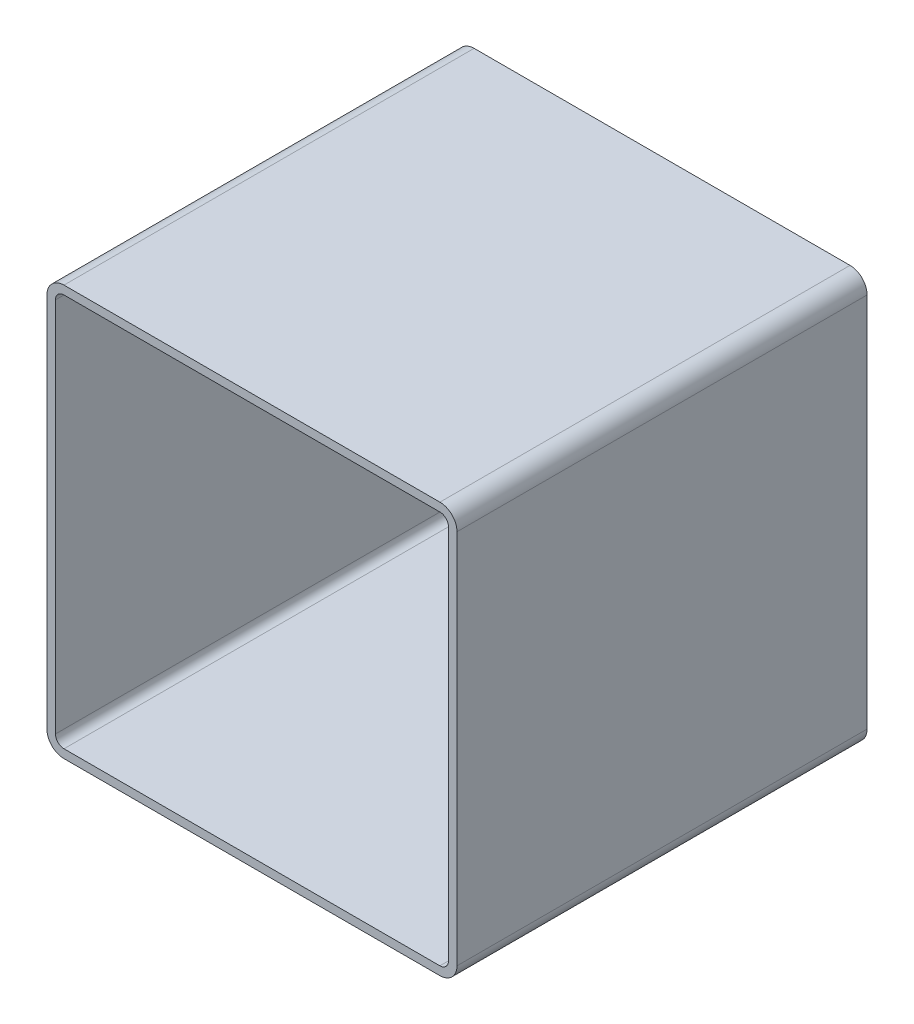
ISO-10303-21;
HEADER;
FILE_DESCRIPTION(('STEP AP214'),'2;1');
FILE_NAME('part.step','',(''),(''),'','','');
FILE_SCHEMA(('AUTOMOTIVE_DESIGN { 1 0 10303 214 1 1 1 1 }'));
ENDSEC;
DATA;
#1=APPLICATION_CONTEXT('core data for automotive mechanical design processes');
#2=APPLICATION_PROTOCOL_DEFINITION('international standard','automotive_design',2000,#1);
#3=PRODUCT_CONTEXT('',#1,'mechanical');
#4=PRODUCT('Part','Part','',(#3));
#5=PRODUCT_RELATED_PRODUCT_CATEGORY('part','',(#4));
#6=PRODUCT_DEFINITION_FORMATION('','',#4);
#7=PRODUCT_DEFINITION_CONTEXT('part definition',#1,'design');
#8=PRODUCT_DEFINITION('design','',#6,#7);
#9=PRODUCT_DEFINITION_SHAPE('','',#8);
#10=(LENGTH_UNIT() NAMED_UNIT(*) SI_UNIT(.MILLI.,.METRE.));
#11=(NAMED_UNIT(*) PLANE_ANGLE_UNIT() SI_UNIT($,.RADIAN.));
#12=(NAMED_UNIT(*) SI_UNIT($,.STERADIAN.) SOLID_ANGLE_UNIT());
#13=UNCERTAINTY_MEASURE_WITH_UNIT(LENGTH_MEASURE(1.E-05),#10,'distance_accuracy_value','');
#14=(GEOMETRIC_REPRESENTATION_CONTEXT(3) GLOBAL_UNCERTAINTY_ASSIGNED_CONTEXT((#13)) GLOBAL_UNIT_ASSIGNED_CONTEXT((#10,
#11,#12)) REPRESENTATION_CONTEXT('',''));
#15=CARTESIAN_POINT('',(0.,0.,0.));
#16=DIRECTION('',(0.,0.,1.));
#17=DIRECTION('',(1.,0.,0.));
#18=AXIS2_PLACEMENT_3D('',#15,#16,#17);
#19=CARTESIAN_POINT('',(13.8067030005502,293.974496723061,304.8));
#20=DIRECTION('',(0.,0.,1.));
#21=DIRECTION('',(1.,0.,0.));
#22=AXIS2_PLACEMENT_3D('',#19,#20,#21);
#23=PLANE('',#22);
#24=CARTESIAN_POINT('',(13.8067030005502,293.974496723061,304.8));
#25=DIRECTION('',(0.,0.,1.));
#26=DIRECTION('',(1.,0.,0.));
#27=AXIS2_PLACEMENT_3D('',#24,#25,#26);
#28=CIRCLE('',#27,12.7);
#29=CARTESIAN_POINT('',(13.8067030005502,306.674496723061,304.8));
#30=VERTEX_POINT('',#29);
#31=CARTESIAN_POINT('',(1.10670300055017,293.974496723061,304.8));
#32=VERTEX_POINT('',#31);
#33=EDGE_CURVE('E211',#30,#32,#28,.T.);
#34=ORIENTED_EDGE('',*,*,#33,.T.);
#35=DIRECTION('',(0.,-1.,0.));
#36=VECTOR('',#35,1.);
#37=CARTESIAN_POINT('',(1.10670300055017,14.5744967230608,304.8));
#38=LINE('',#37,#36);
#39=CARTESIAN_POINT('',(1.10670300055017,14.5744967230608,304.8));
#40=VERTEX_POINT('',#39);
#41=EDGE_CURVE('E214',#32,#40,#38,.T.);
#42=ORIENTED_EDGE('',*,*,#41,.T.);
#43=CARTESIAN_POINT('',(13.8067030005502,14.5744967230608,304.8));
#44=DIRECTION('',(0.,0.,1.));
#45=DIRECTION('',(1.,0.,0.));
#46=AXIS2_PLACEMENT_3D('',#43,#44,#45);
#47=CIRCLE('',#46,12.7);
#48=CARTESIAN_POINT('',(13.8067030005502,1.87449672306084,304.8));
#49=VERTEX_POINT('',#48);
#50=EDGE_CURVE('E217',#40,#49,#47,.T.);
#51=ORIENTED_EDGE('',*,*,#50,.T.);
#52=DIRECTION('',(1.,0.,0.));
#53=VECTOR('',#52,1.);
#54=CARTESIAN_POINT('',(293.20670300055,1.87449672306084,304.8));
#55=LINE('',#54,#53);
#56=CARTESIAN_POINT('',(293.20670300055,1.87449672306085,304.8));
#57=VERTEX_POINT('',#56);
#58=EDGE_CURVE('E219',#49,#57,#55,.T.);
#59=ORIENTED_EDGE('',*,*,#58,.T.);
#60=CARTESIAN_POINT('',(293.20670300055,14.5744967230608,304.8));
#61=DIRECTION('',(0.,0.,1.));
#62=DIRECTION('',(1.,0.,0.));
#63=AXIS2_PLACEMENT_3D('',#60,#61,#62);
#64=CIRCLE('',#63,12.7);
#65=CARTESIAN_POINT('',(305.90670300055,14.5744967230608,304.8));
#66=VERTEX_POINT('',#65);
#67=EDGE_CURVE('E221',#57,#66,#64,.T.);
#68=ORIENTED_EDGE('',*,*,#67,.T.);
#69=DIRECTION('',(0.,1.,0.));
#70=VECTOR('',#69,1.);
#71=CARTESIAN_POINT('',(305.90670300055,293.974496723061,304.8));
#72=LINE('',#71,#70);
#73=CARTESIAN_POINT('',(305.90670300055,293.974496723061,304.8));
#74=VERTEX_POINT('',#73);
#75=EDGE_CURVE('E223',#66,#74,#72,.T.);
#76=ORIENTED_EDGE('',*,*,#75,.T.);
#77=CARTESIAN_POINT('',(293.20670300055,293.974496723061,304.8));
#78=DIRECTION('',(0.,0.,1.));
#79=DIRECTION('',(1.,0.,0.));
#80=AXIS2_PLACEMENT_3D('',#77,#78,#79);
#81=CIRCLE('',#80,12.7);
#82=CARTESIAN_POINT('',(293.20670300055,306.674496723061,304.8));
#83=VERTEX_POINT('',#82);
#84=EDGE_CURVE('E225',#74,#83,#81,.T.);
#85=ORIENTED_EDGE('',*,*,#84,.T.);
#86=DIRECTION('',(-1.,0.,0.));
#87=VECTOR('',#86,1.);
#88=CARTESIAN_POINT('',(13.8067030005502,306.674496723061,304.8));
#89=LINE('',#88,#87);
#90=EDGE_CURVE('E227',#83,#30,#89,.T.);
#91=ORIENTED_EDGE('',*,*,#90,.T.);
#92=EDGE_LOOP('',(#34,#42,#51,#59,#68,#76,#85,#91));
#93=FACE_BOUND('',#92,.T.);
#94=DIRECTION('',(0.,-1.,0.));
#95=VECTOR('',#94,1.);
#96=CARTESIAN_POINT('',(7.45670300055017,14.5744967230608,304.8));
#97=LINE('',#96,#95);
#98=CARTESIAN_POINT('',(7.45670300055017,293.974496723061,304.8));
#99=VERTEX_POINT('',#98);
#100=CARTESIAN_POINT('',(7.45670300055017,14.5744967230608,304.8));
#101=VERTEX_POINT('',#100);
#102=EDGE_CURVE('E154',#99,#101,#97,.T.);
#103=ORIENTED_EDGE('',*,*,#102,.F.);
#104=CARTESIAN_POINT('',(13.8067030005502,293.974496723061,304.8));
#105=DIRECTION('',(0.,0.,1.));
#106=DIRECTION('',(1.,0.,0.));
#107=AXIS2_PLACEMENT_3D('',#104,#105,#106);
#108=CIRCLE('',#107,6.35000000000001);
#109=CARTESIAN_POINT('',(13.8067030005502,300.324496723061,304.8));
#110=VERTEX_POINT('',#109);
#111=EDGE_CURVE('E146',#110,#99,#108,.T.);
#112=ORIENTED_EDGE('',*,*,#111,.F.);
#113=DIRECTION('',(-1.,0.,0.));
#114=VECTOR('',#113,1.);
#115=CARTESIAN_POINT('',(13.8067030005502,300.324496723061,304.8));
#116=LINE('',#115,#114);
#117=CARTESIAN_POINT('',(293.20670300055,300.324496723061,304.8));
#118=VERTEX_POINT('',#117);
#119=EDGE_CURVE('E179',#118,#110,#116,.T.);
#120=ORIENTED_EDGE('',*,*,#119,.F.);
#121=CARTESIAN_POINT('',(293.20670300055,293.974496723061,304.8));
#122=DIRECTION('',(0.,0.,1.));
#123=DIRECTION('',(1.,0.,0.));
#124=AXIS2_PLACEMENT_3D('',#121,#122,#123);
#125=CIRCLE('',#124,6.34999999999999);
#126=CARTESIAN_POINT('',(299.55670300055,293.974496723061,304.8));
#127=VERTEX_POINT('',#126);
#128=EDGE_CURVE('E177',#127,#118,#125,.T.);
#129=ORIENTED_EDGE('',*,*,#128,.F.);
#130=DIRECTION('',(0.,1.,0.));
#131=VECTOR('',#130,1.);
#132=CARTESIAN_POINT('',(299.55670300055,293.974496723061,304.8));
#133=LINE('',#132,#131);
#134=CARTESIAN_POINT('',(299.55670300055,14.5744967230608,304.8));
#135=VERTEX_POINT('',#134);
#136=EDGE_CURVE('E175',#135,#127,#133,.T.);
#137=ORIENTED_EDGE('',*,*,#136,.F.);
#138=CARTESIAN_POINT('',(293.20670300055,14.5744967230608,304.8));
#139=DIRECTION('',(0.,0.,1.));
#140=DIRECTION('',(1.,0.,0.));
#141=AXIS2_PLACEMENT_3D('',#138,#139,#140);
#142=CIRCLE('',#141,6.34999999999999);
#143=CARTESIAN_POINT('',(293.20670300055,8.22449672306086,304.8));
#144=VERTEX_POINT('',#143);
#145=EDGE_CURVE('E173',#144,#135,#142,.T.);
#146=ORIENTED_EDGE('',*,*,#145,.F.);
#147=DIRECTION('',(1.,0.,0.));
#148=VECTOR('',#147,1.);
#149=CARTESIAN_POINT('',(293.20670300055,8.22449672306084,304.8));
#150=LINE('',#149,#148);
#151=CARTESIAN_POINT('',(13.8067030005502,8.22449672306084,304.8));
#152=VERTEX_POINT('',#151);
#153=EDGE_CURVE('E169',#152,#144,#150,.T.);
#154=ORIENTED_EDGE('',*,*,#153,.F.);
#155=CARTESIAN_POINT('',(13.8067030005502,14.5744967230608,304.8));
#156=DIRECTION('',(0.,0.,1.));
#157=DIRECTION('',(1.,0.,0.));
#158=AXIS2_PLACEMENT_3D('',#155,#156,#157);
#159=CIRCLE('',#158,6.35);
#160=EDGE_CURVE('E167',#101,#152,#159,.T.);
#161=ORIENTED_EDGE('',*,*,#160,.F.);
#162=EDGE_LOOP('',(#103,#112,#120,#129,#137,#146,#154,#161));
#163=FACE_BOUND('',#162,.T.);
#164=ADVANCED_FACE('F33',(#93,#163),#23,.T.);
#165=CARTESIAN_POINT('',(13.8067030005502,293.974496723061,0.));
#166=DIRECTION('',(0.,0.,1.));
#167=DIRECTION('',(1.,0.,0.));
#168=AXIS2_PLACEMENT_3D('',#165,#166,#167);
#169=PLANE('',#168);
#170=CARTESIAN_POINT('',(13.8067030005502,293.974496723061,0.));
#171=DIRECTION('',(0.,0.,1.));
#172=DIRECTION('',(1.,0.,0.));
#173=AXIS2_PLACEMENT_3D('',#170,#171,#172);
#174=CIRCLE('',#173,12.7);
#175=CARTESIAN_POINT('',(13.8067030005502,306.674496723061,0.));
#176=VERTEX_POINT('',#175);
#177=CARTESIAN_POINT('',(1.10670300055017,293.974496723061,0.));
#178=VERTEX_POINT('',#177);
#179=EDGE_CURVE('E162',#176,#178,#174,.T.);
#180=ORIENTED_EDGE('',*,*,#179,.F.);
#181=DIRECTION('',(-1.,0.,0.));
#182=VECTOR('',#181,1.);
#183=CARTESIAN_POINT('',(13.8067030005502,306.674496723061,0.));
#184=LINE('',#183,#182);
#185=CARTESIAN_POINT('',(293.20670300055,306.674496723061,0.));
#186=VERTEX_POINT('',#185);
#187=EDGE_CURVE('E215',#186,#176,#184,.T.);
#188=ORIENTED_EDGE('',*,*,#187,.F.);
#189=CARTESIAN_POINT('',(293.20670300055,293.974496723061,0.));
#190=DIRECTION('',(0.,0.,1.));
#191=DIRECTION('',(1.,0.,0.));
#192=AXIS2_PLACEMENT_3D('',#189,#190,#191);
#193=CIRCLE('',#192,12.7);
#194=CARTESIAN_POINT('',(305.90670300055,293.974496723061,0.));
#195=VERTEX_POINT('',#194);
#196=EDGE_CURVE('E242',#195,#186,#193,.T.);
#197=ORIENTED_EDGE('',*,*,#196,.F.);
#198=DIRECTION('',(0.,1.,0.));
#199=VECTOR('',#198,1.);
#200=CARTESIAN_POINT('',(305.90670300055,293.974496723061,0.));
#201=LINE('',#200,#199);
#202=CARTESIAN_POINT('',(305.90670300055,14.5744967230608,0.));
#203=VERTEX_POINT('',#202);
#204=EDGE_CURVE('E240',#203,#195,#201,.T.);
#205=ORIENTED_EDGE('',*,*,#204,.F.);
#206=CARTESIAN_POINT('',(293.20670300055,14.5744967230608,0.));
#207=DIRECTION('',(0.,0.,1.));
#208=DIRECTION('',(1.,0.,0.));
#209=AXIS2_PLACEMENT_3D('',#206,#207,#208);
#210=CIRCLE('',#209,12.7);
#211=CARTESIAN_POINT('',(293.20670300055,1.87449672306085,0.));
#212=VERTEX_POINT('',#211);
#213=EDGE_CURVE('E238',#212,#203,#210,.T.);
#214=ORIENTED_EDGE('',*,*,#213,.F.);
#215=DIRECTION('',(1.,0.,0.));
#216=VECTOR('',#215,1.);
#217=CARTESIAN_POINT('',(293.20670300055,1.87449672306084,0.));
#218=LINE('',#217,#216);
#219=CARTESIAN_POINT('',(13.8067030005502,1.87449672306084,0.));
#220=VERTEX_POINT('',#219);
#221=EDGE_CURVE('E236',#220,#212,#218,.T.);
#222=ORIENTED_EDGE('',*,*,#221,.F.);
#223=CARTESIAN_POINT('',(13.8067030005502,14.5744967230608,0.));
#224=DIRECTION('',(0.,0.,1.));
#225=DIRECTION('',(1.,0.,0.));
#226=AXIS2_PLACEMENT_3D('',#223,#224,#225);
#227=CIRCLE('',#226,12.7);
#228=CARTESIAN_POINT('',(1.10670300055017,14.5744967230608,0.));
#229=VERTEX_POINT('',#228);
#230=EDGE_CURVE('E234',#229,#220,#227,.T.);
#231=ORIENTED_EDGE('',*,*,#230,.F.);
#232=DIRECTION('',(0.,-1.,0.));
#233=VECTOR('',#232,1.);
#234=CARTESIAN_POINT('',(1.10670300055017,14.5744967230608,0.));
#235=LINE('',#234,#233);
#236=EDGE_CURVE('E232',#178,#229,#235,.T.);
#237=ORIENTED_EDGE('',*,*,#236,.F.);
#238=EDGE_LOOP('',(#180,#188,#197,#205,#214,#222,#231,#237));
#239=FACE_BOUND('',#238,.T.);
#240=CARTESIAN_POINT('',(13.8067030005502,293.974496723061,0.));
#241=DIRECTION('',(0.,0.,1.));
#242=DIRECTION('',(1.,0.,0.));
#243=AXIS2_PLACEMENT_3D('',#240,#241,#242);
#244=CIRCLE('',#243,6.35000000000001);
#245=CARTESIAN_POINT('',(13.8067030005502,300.324496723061,0.));
#246=VERTEX_POINT('',#245);
#247=CARTESIAN_POINT('',(7.45670300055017,293.974496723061,0.));
#248=VERTEX_POINT('',#247);
#249=EDGE_CURVE('E56',#246,#248,#244,.T.);
#250=ORIENTED_EDGE('',*,*,#249,.T.);
#251=DIRECTION('',(0.,-1.,0.));
#252=VECTOR('',#251,1.);
#253=CARTESIAN_POINT('',(7.45670300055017,14.5744967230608,0.));
#254=LINE('',#253,#252);
#255=CARTESIAN_POINT('',(7.45670300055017,14.5744967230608,0.));
#256=VERTEX_POINT('',#255);
#257=EDGE_CURVE('E161',#248,#256,#254,.T.);
#258=ORIENTED_EDGE('',*,*,#257,.T.);
#259=CARTESIAN_POINT('',(13.8067030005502,14.5744967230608,0.));
#260=DIRECTION('',(0.,0.,1.));
#261=DIRECTION('',(1.,0.,0.));
#262=AXIS2_PLACEMENT_3D('',#259,#260,#261);
#263=CIRCLE('',#262,6.35);
#264=CARTESIAN_POINT('',(13.8067030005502,8.22449672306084,0.));
#265=VERTEX_POINT('',#264);
#266=EDGE_CURVE('E183',#256,#265,#263,.T.);
#267=ORIENTED_EDGE('',*,*,#266,.T.);
#268=DIRECTION('',(1.,0.,0.));
#269=VECTOR('',#268,1.);
#270=CARTESIAN_POINT('',(293.20670300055,8.22449672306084,0.));
#271=LINE('',#270,#269);
#272=CARTESIAN_POINT('',(293.20670300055,8.22449672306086,0.));
#273=VERTEX_POINT('',#272);
#274=EDGE_CURVE('E186',#265,#273,#271,.T.);
#275=ORIENTED_EDGE('',*,*,#274,.T.);
#276=CARTESIAN_POINT('',(293.20670300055,14.5744967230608,0.));
#277=DIRECTION('',(0.,0.,1.));
#278=DIRECTION('',(1.,0.,0.));
#279=AXIS2_PLACEMENT_3D('',#276,#277,#278);
#280=CIRCLE('',#279,6.34999999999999);
#281=CARTESIAN_POINT('',(299.55670300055,14.5744967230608,0.));
#282=VERTEX_POINT('',#281);
#283=EDGE_CURVE('E189',#273,#282,#280,.T.);
#284=ORIENTED_EDGE('',*,*,#283,.T.);
#285=DIRECTION('',(0.,1.,0.));
#286=VECTOR('',#285,1.);
#287=CARTESIAN_POINT('',(299.55670300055,293.974496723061,0.));
#288=LINE('',#287,#286);
#289=CARTESIAN_POINT('',(299.55670300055,293.974496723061,0.));
#290=VERTEX_POINT('',#289);
#291=EDGE_CURVE('E192',#282,#290,#288,.T.);
#292=ORIENTED_EDGE('',*,*,#291,.T.);
#293=CARTESIAN_POINT('',(293.20670300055,293.974496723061,0.));
#294=DIRECTION('',(0.,0.,1.));
#295=DIRECTION('',(1.,0.,0.));
#296=AXIS2_PLACEMENT_3D('',#293,#294,#295);
#297=CIRCLE('',#296,6.34999999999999);
#298=CARTESIAN_POINT('',(293.20670300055,300.324496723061,0.));
#299=VERTEX_POINT('',#298);
#300=EDGE_CURVE('E195',#290,#299,#297,.T.);
#301=ORIENTED_EDGE('',*,*,#300,.T.);
#302=DIRECTION('',(-1.,0.,0.));
#303=VECTOR('',#302,1.);
#304=CARTESIAN_POINT('',(13.8067030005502,300.324496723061,0.));
#305=LINE('',#304,#303);
#306=EDGE_CURVE('E155',#299,#246,#305,.T.);
#307=ORIENTED_EDGE('',*,*,#306,.T.);
#308=EDGE_LOOP('',(#250,#258,#267,#275,#284,#292,#301,#307));
#309=FACE_BOUND('',#308,.T.);
#310=ADVANCED_FACE('F272',(#239,#309),#169,.F.);
#311=CARTESIAN_POINT('',(13.8067030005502,293.974496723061,304.8));
#312=DIRECTION('',(0.,0.,-1.));
#313=DIRECTION('',(-1.,0.,0.));
#314=AXIS2_PLACEMENT_3D('',#311,#312,#313);
#315=CYLINDRICAL_SURFACE('',#314,12.7);
#316=ORIENTED_EDGE('',*,*,#179,.T.);
#317=DIRECTION('',(0.,0.,-1.));
#318=VECTOR('',#317,1.);
#319=CARTESIAN_POINT('',(1.10670300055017,293.974496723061,304.8));
#320=LINE('',#319,#318);
#321=EDGE_CURVE('E11',#32,#178,#320,.T.);
#322=ORIENTED_EDGE('',*,*,#321,.F.);
#323=ORIENTED_EDGE('',*,*,#33,.F.);
#324=DIRECTION('',(0.,0.,-1.));
#325=VECTOR('',#324,1.);
#326=CARTESIAN_POINT('',(13.8067030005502,306.674496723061,304.8));
#327=LINE('',#326,#325);
#328=EDGE_CURVE('E229',#30,#176,#327,.T.);
#329=ORIENTED_EDGE('',*,*,#328,.T.);
#330=EDGE_LOOP('',(#316,#322,#323,#329));
#331=FACE_BOUND('',#330,.T.);
#332=ADVANCED_FACE('F35',(#331),#315,.T.);
#333=CARTESIAN_POINT('',(1.10670300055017,14.5744967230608,304.8));
#334=DIRECTION('',(1.,0.,0.));
#335=DIRECTION('',(0.,0.,-1.));
#336=AXIS2_PLACEMENT_3D('',#333,#334,#335);
#337=PLANE('',#336);
#338=ORIENTED_EDGE('',*,*,#236,.T.);
#339=DIRECTION('',(0.,0.,-1.));
#340=VECTOR('',#339,1.);
#341=CARTESIAN_POINT('',(1.10670300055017,14.5744967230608,304.8));
#342=LINE('',#341,#340);
#343=EDGE_CURVE('E41',#40,#229,#342,.T.);
#344=ORIENTED_EDGE('',*,*,#343,.F.);
#345=ORIENTED_EDGE('',*,*,#41,.F.);
#346=ORIENTED_EDGE('',*,*,#321,.T.);
#347=EDGE_LOOP('',(#338,#344,#345,#346));
#348=FACE_BOUND('',#347,.T.);
#349=ADVANCED_FACE('F289',(#348),#337,.F.);
#350=CARTESIAN_POINT('',(13.8067030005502,14.5744967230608,304.8));
#351=DIRECTION('',(0.,0.,-1.));
#352=DIRECTION('',(-1.,0.,0.));
#353=AXIS2_PLACEMENT_3D('',#350,#351,#352);
#354=CYLINDRICAL_SURFACE('',#353,12.7);
#355=ORIENTED_EDGE('',*,*,#230,.T.);
#356=DIRECTION('',(0.,0.,-1.));
#357=VECTOR('',#356,1.);
#358=CARTESIAN_POINT('',(13.8067030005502,1.87449672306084,304.8));
#359=LINE('',#358,#357);
#360=EDGE_CURVE('E259',#49,#220,#359,.T.);
#361=ORIENTED_EDGE('',*,*,#360,.F.);
#362=ORIENTED_EDGE('',*,*,#50,.F.);
#363=ORIENTED_EDGE('',*,*,#343,.T.);
#364=EDGE_LOOP('',(#355,#361,#362,#363));
#365=FACE_BOUND('',#364,.T.);
#366=ADVANCED_FACE('F266',(#365),#354,.T.);
#367=CARTESIAN_POINT('',(293.20670300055,1.87449672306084,304.8));
#368=DIRECTION('',(0.,1.,0.));
#369=DIRECTION('',(0.,0.,1.));
#370=AXIS2_PLACEMENT_3D('',#367,#368,#369);
#371=PLANE('',#370);
#372=ORIENTED_EDGE('',*,*,#221,.T.);
#373=DIRECTION('',(0.,0.,-1.));
#374=VECTOR('',#373,1.);
#375=CARTESIAN_POINT('',(293.20670300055,1.87449672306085,304.8));
#376=LINE('',#375,#374);
#377=EDGE_CURVE('E256',#57,#212,#376,.T.);
#378=ORIENTED_EDGE('',*,*,#377,.F.);
#379=ORIENTED_EDGE('',*,*,#58,.F.);
#380=ORIENTED_EDGE('',*,*,#360,.T.);
#381=EDGE_LOOP('',(#372,#378,#379,#380));
#382=FACE_BOUND('',#381,.T.);
#383=ADVANCED_FACE('F278',(#382),#371,.F.);
#384=CARTESIAN_POINT('',(293.20670300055,14.5744967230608,304.8));
#385=DIRECTION('',(0.,0.,-1.));
#386=DIRECTION('',(-1.,0.,0.));
#387=AXIS2_PLACEMENT_3D('',#384,#385,#386);
#388=CYLINDRICAL_SURFACE('',#387,12.7);
#389=ORIENTED_EDGE('',*,*,#213,.T.);
#390=DIRECTION('',(0.,0.,-1.));
#391=VECTOR('',#390,1.);
#392=CARTESIAN_POINT('',(305.90670300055,14.5744967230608,304.8));
#393=LINE('',#392,#391);
#394=EDGE_CURVE('E253',#66,#203,#393,.T.);
#395=ORIENTED_EDGE('',*,*,#394,.F.);
#396=ORIENTED_EDGE('',*,*,#67,.F.);
#397=ORIENTED_EDGE('',*,*,#377,.T.);
#398=EDGE_LOOP('',(#389,#395,#396,#397));
#399=FACE_BOUND('',#398,.T.);
#400=ADVANCED_FACE('F282',(#399),#388,.T.);
#401=CARTESIAN_POINT('',(305.90670300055,293.974496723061,304.8));
#402=DIRECTION('',(-1.,0.,0.));
#403=DIRECTION('',(0.,0.,1.));
#404=AXIS2_PLACEMENT_3D('',#401,#402,#403);
#405=PLANE('',#404);
#406=ORIENTED_EDGE('',*,*,#204,.T.);
#407=DIRECTION('',(0.,0.,-1.));
#408=VECTOR('',#407,1.);
#409=CARTESIAN_POINT('',(305.90670300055,293.974496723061,304.8));
#410=LINE('',#409,#408);
#411=EDGE_CURVE('E250',#74,#195,#410,.T.);
#412=ORIENTED_EDGE('',*,*,#411,.F.);
#413=ORIENTED_EDGE('',*,*,#75,.F.);
#414=ORIENTED_EDGE('',*,*,#394,.T.);
#415=EDGE_LOOP('',(#406,#412,#413,#414));
#416=FACE_BOUND('',#415,.T.);
#417=ADVANCED_FACE('F302',(#416),#405,.F.);
#418=CARTESIAN_POINT('',(293.20670300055,293.974496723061,304.8));
#419=DIRECTION('',(0.,0.,-1.));
#420=DIRECTION('',(-1.,0.,0.));
#421=AXIS2_PLACEMENT_3D('',#418,#419,#420);
#422=CYLINDRICAL_SURFACE('',#421,12.7);
#423=ORIENTED_EDGE('',*,*,#196,.T.);
#424=DIRECTION('',(0.,0.,-1.));
#425=VECTOR('',#424,1.);
#426=CARTESIAN_POINT('',(293.20670300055,306.674496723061,304.8));
#427=LINE('',#426,#425);
#428=EDGE_CURVE('E247',#83,#186,#427,.T.);
#429=ORIENTED_EDGE('',*,*,#428,.F.);
#430=ORIENTED_EDGE('',*,*,#84,.F.);
#431=ORIENTED_EDGE('',*,*,#411,.T.);
#432=EDGE_LOOP('',(#423,#429,#430,#431));
#433=FACE_BOUND('',#432,.T.);
#434=ADVANCED_FACE('F300',(#433),#422,.T.);
#435=CARTESIAN_POINT('',(13.8067030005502,306.674496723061,304.8));
#436=DIRECTION('',(0.,-1.,0.));
#437=DIRECTION('',(0.,0.,-1.));
#438=AXIS2_PLACEMENT_3D('',#435,#436,#437);
#439=PLANE('',#438);
#440=ORIENTED_EDGE('',*,*,#187,.T.);
#441=ORIENTED_EDGE('',*,*,#328,.F.);
#442=ORIENTED_EDGE('',*,*,#90,.F.);
#443=ORIENTED_EDGE('',*,*,#428,.T.);
#444=EDGE_LOOP('',(#440,#441,#442,#443));
#445=FACE_BOUND('',#444,.T.);
#446=ADVANCED_FACE('F295',(#445),#439,.F.);
#447=CARTESIAN_POINT('',(13.8067030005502,293.974496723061,304.8));
#448=DIRECTION('',(0.,0.,-1.));
#449=DIRECTION('',(-1.,0.,0.));
#450=AXIS2_PLACEMENT_3D('',#447,#448,#449);
#451=CYLINDRICAL_SURFACE('',#450,6.35000000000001);
#452=ORIENTED_EDGE('',*,*,#249,.F.);
#453=DIRECTION('',(0.,0.,-1.));
#454=VECTOR('',#453,1.);
#455=CARTESIAN_POINT('',(13.8067030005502,300.324496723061,304.8));
#456=LINE('',#455,#454);
#457=EDGE_CURVE('E150',#110,#246,#456,.T.);
#458=ORIENTED_EDGE('',*,*,#457,.F.);
#459=ORIENTED_EDGE('',*,*,#111,.T.);
#460=DIRECTION('',(0.,0.,-1.));
#461=VECTOR('',#460,1.);
#462=CARTESIAN_POINT('',(7.45670300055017,293.974496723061,304.8));
#463=LINE('',#462,#461);
#464=EDGE_CURVE('E149',#99,#248,#463,.T.);
#465=ORIENTED_EDGE('',*,*,#464,.T.);
#466=EDGE_LOOP('',(#452,#458,#459,#465));
#467=FACE_BOUND('',#466,.T.);
#468=ADVANCED_FACE('F148',(#467),#451,.F.);
#469=CARTESIAN_POINT('',(7.45670300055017,14.5744967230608,304.8));
#470=DIRECTION('',(1.,0.,0.));
#471=DIRECTION('',(0.,0.,-1.));
#472=AXIS2_PLACEMENT_3D('',#469,#470,#471);
#473=PLANE('',#472);
#474=ORIENTED_EDGE('',*,*,#257,.F.);
#475=ORIENTED_EDGE('',*,*,#464,.F.);
#476=ORIENTED_EDGE('',*,*,#102,.T.);
#477=DIRECTION('',(0.,0.,-1.));
#478=VECTOR('',#477,1.);
#479=CARTESIAN_POINT('',(7.45670300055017,14.5744967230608,304.8));
#480=LINE('',#479,#478);
#481=EDGE_CURVE('E163',#101,#256,#480,.T.);
#482=ORIENTED_EDGE('',*,*,#481,.T.);
#483=EDGE_LOOP('',(#474,#475,#476,#482));
#484=FACE_BOUND('',#483,.T.);
#485=ADVANCED_FACE('F158',(#484),#473,.T.);
#486=CARTESIAN_POINT('',(13.8067030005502,14.5744967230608,304.8));
#487=DIRECTION('',(0.,0.,-1.));
#488=DIRECTION('',(-1.,0.,0.));
#489=AXIS2_PLACEMENT_3D('',#486,#487,#488);
#490=CYLINDRICAL_SURFACE('',#489,6.35);
#491=ORIENTED_EDGE('',*,*,#266,.F.);
#492=ORIENTED_EDGE('',*,*,#481,.F.);
#493=ORIENTED_EDGE('',*,*,#160,.T.);
#494=DIRECTION('',(0.,0.,-1.));
#495=VECTOR('',#494,1.);
#496=CARTESIAN_POINT('',(13.8067030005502,8.22449672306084,304.8));
#497=LINE('',#496,#495);
#498=EDGE_CURVE('E208',#152,#265,#497,.T.);
#499=ORIENTED_EDGE('',*,*,#498,.T.);
#500=EDGE_LOOP('',(#491,#492,#493,#499));
#501=FACE_BOUND('',#500,.T.);
#502=ADVANCED_FACE('F327',(#501),#490,.F.);
#503=CARTESIAN_POINT('',(293.20670300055,8.22449672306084,304.8));
#504=DIRECTION('',(0.,1.,0.));
#505=DIRECTION('',(0.,0.,1.));
#506=AXIS2_PLACEMENT_3D('',#503,#504,#505);
#507=PLANE('',#506);
#508=ORIENTED_EDGE('',*,*,#274,.F.);
#509=ORIENTED_EDGE('',*,*,#498,.F.);
#510=ORIENTED_EDGE('',*,*,#153,.T.);
#511=DIRECTION('',(0.,0.,-1.));
#512=VECTOR('',#511,1.);
#513=CARTESIAN_POINT('',(293.20670300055,8.22449672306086,304.8));
#514=LINE('',#513,#512);
#515=EDGE_CURVE('E206',#144,#273,#514,.T.);
#516=ORIENTED_EDGE('',*,*,#515,.T.);
#517=EDGE_LOOP('',(#508,#509,#510,#516));
#518=FACE_BOUND('',#517,.T.);
#519=ADVANCED_FACE('F331',(#518),#507,.T.);
#520=CARTESIAN_POINT('',(293.20670300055,14.5744967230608,304.8));
#521=DIRECTION('',(0.,0.,-1.));
#522=DIRECTION('',(-1.,0.,0.));
#523=AXIS2_PLACEMENT_3D('',#520,#521,#522);
#524=CYLINDRICAL_SURFACE('',#523,6.34999999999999);
#525=ORIENTED_EDGE('',*,*,#283,.F.);
#526=ORIENTED_EDGE('',*,*,#515,.F.);
#527=ORIENTED_EDGE('',*,*,#145,.T.);
#528=DIRECTION('',(0.,0.,-1.));
#529=VECTOR('',#528,1.);
#530=CARTESIAN_POINT('',(299.55670300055,14.5744967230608,304.8));
#531=LINE('',#530,#529);
#532=EDGE_CURVE('E204',#135,#282,#531,.T.);
#533=ORIENTED_EDGE('',*,*,#532,.T.);
#534=EDGE_LOOP('',(#525,#526,#527,#533));
#535=FACE_BOUND('',#534,.T.);
#536=ADVANCED_FACE('F337',(#535),#524,.F.);
#537=CARTESIAN_POINT('',(299.55670300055,293.974496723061,304.8));
#538=DIRECTION('',(-1.,0.,0.));
#539=DIRECTION('',(0.,0.,1.));
#540=AXIS2_PLACEMENT_3D('',#537,#538,#539);
#541=PLANE('',#540);
#542=ORIENTED_EDGE('',*,*,#291,.F.);
#543=ORIENTED_EDGE('',*,*,#532,.F.);
#544=ORIENTED_EDGE('',*,*,#136,.T.);
#545=DIRECTION('',(0.,0.,-1.));
#546=VECTOR('',#545,1.);
#547=CARTESIAN_POINT('',(299.55670300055,293.974496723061,304.8));
#548=LINE('',#547,#546);
#549=EDGE_CURVE('E202',#127,#290,#548,.T.);
#550=ORIENTED_EDGE('',*,*,#549,.T.);
#551=EDGE_LOOP('',(#542,#543,#544,#550));
#552=FACE_BOUND('',#551,.T.);
#553=ADVANCED_FACE('F341',(#552),#541,.T.);
#554=CARTESIAN_POINT('',(293.20670300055,293.974496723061,304.8));
#555=DIRECTION('',(0.,0.,-1.));
#556=DIRECTION('',(-1.,0.,0.));
#557=AXIS2_PLACEMENT_3D('',#554,#555,#556);
#558=CYLINDRICAL_SURFACE('',#557,6.34999999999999);
#559=ORIENTED_EDGE('',*,*,#300,.F.);
#560=ORIENTED_EDGE('',*,*,#549,.F.);
#561=ORIENTED_EDGE('',*,*,#128,.T.);
#562=DIRECTION('',(0.,0.,-1.));
#563=VECTOR('',#562,1.);
#564=CARTESIAN_POINT('',(293.20670300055,300.324496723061,304.8));
#565=LINE('',#564,#563);
#566=EDGE_CURVE('E48',#118,#299,#565,.T.);
#567=ORIENTED_EDGE('',*,*,#566,.T.);
#568=EDGE_LOOP('',(#559,#560,#561,#567));
#569=FACE_BOUND('',#568,.T.);
#570=ADVANCED_FACE('F345',(#569),#558,.F.);
#571=CARTESIAN_POINT('',(13.8067030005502,300.324496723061,304.8));
#572=DIRECTION('',(0.,-1.,0.));
#573=DIRECTION('',(0.,0.,-1.));
#574=AXIS2_PLACEMENT_3D('',#571,#572,#573);
#575=PLANE('',#574);
#576=ORIENTED_EDGE('',*,*,#306,.F.);
#577=ORIENTED_EDGE('',*,*,#566,.F.);
#578=ORIENTED_EDGE('',*,*,#119,.T.);
#579=ORIENTED_EDGE('',*,*,#457,.T.);
#580=EDGE_LOOP('',(#576,#577,#578,#579));
#581=FACE_BOUND('',#580,.T.);
#582=ADVANCED_FACE('F349',(#581),#575,.T.);
#583=CLOSED_SHELL('',(#164,#310,#332,#349,#366,#383,#400,#417,#434,#446,#468,#485,#502,#519,
#536,#553,#570,#582));
#584=MANIFOLD_SOLID_BREP('B2',#583);
#585=ADVANCED_BREP_SHAPE_REPRESENTATION('',(#18,#584),#14);
#586=SHAPE_DEFINITION_REPRESENTATION(#9,#585);
ENDSEC;
END-ISO-10303-21;
